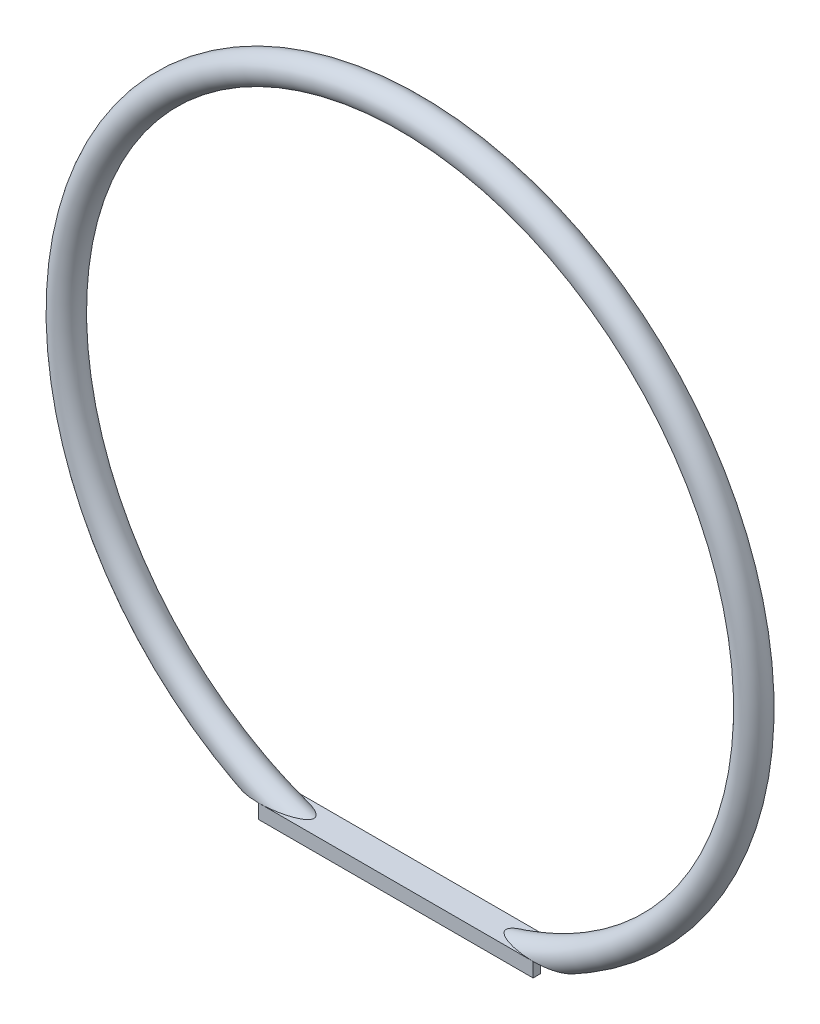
from build123d import *

# Parameters (mm, degrees)
SKETCH2_R           = 12.7
SKETCH2_R_2         = 8.89
SKETCH4_W           = 620.362255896
SKETCH4_H           = 121.831152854
CUT_EXTRUDE1_DEPTH  = 677.207919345
SKETCH5_W           = 243.586
SKETCH5_H           = 25.399996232
BOSS_EXTRUDE1_DEPTH = 6.35
SKETCH6_W           = 243.586
SKETCH6_H           = 6.35
BOSS_EXTRUDE2_DEPTH = 6.35


with BuildPart() as part:
    # Sweep1: sweep along a path in Sketch1
    with BuildLine(Plane.XY) as sweep1_path:
        CenterArc((0, 279.4), 304.8, 0, 360)
    # Sketch2 → Sweep1 (sweep)
    with BuildSketch(Plane(origin=(0, 0, 0), x_dir=(0, 0, -1), z_dir=(1, 0, 0))):
        with Locations((0, -25.4)):
            Circle(SKETCH2_R)
        with Locations((0, -25.4)):
            Circle(SKETCH2_R_2, mode=Mode.SUBTRACT)
    sweep(path=sweep1_path.line)

    # Sketch4 → Cut-Extrude1 (cut, through all)
    with BuildSketch(Plane(origin=(0, 0, 0), x_dir=(1, 0, 0), z_dir=(0, 1, 0))):
        Rectangle(SKETCH4_W, SKETCH4_H)
    extrude(amount=-CUT_EXTRUDE1_DEPTH, mode=Mode.SUBTRACT)

    # Sketch5 → Boss-Extrude1 (add)
    with BuildSketch(Plane(origin=(0, 0, 0), x_dir=(1, 0, 0), z_dir=(0, 1, 0))):
        Rectangle(SKETCH5_W, SKETCH5_H)
    extrude(amount=-BOSS_EXTRUDE1_DEPTH)

    # Sketch6 → Boss-Extrude2 (add)
    with BuildSketch(Plane.XZ.offset(6.35)):
        with Locations((0, 9.524998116)):
            Rectangle(SKETCH6_W, SKETCH6_H)
        with Locations((0, -9.524998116)):
            Rectangle(SKETCH6_W, SKETCH6_H)
    extrude(amount=BOSS_EXTRUDE2_DEPTH)


solid = part.part
